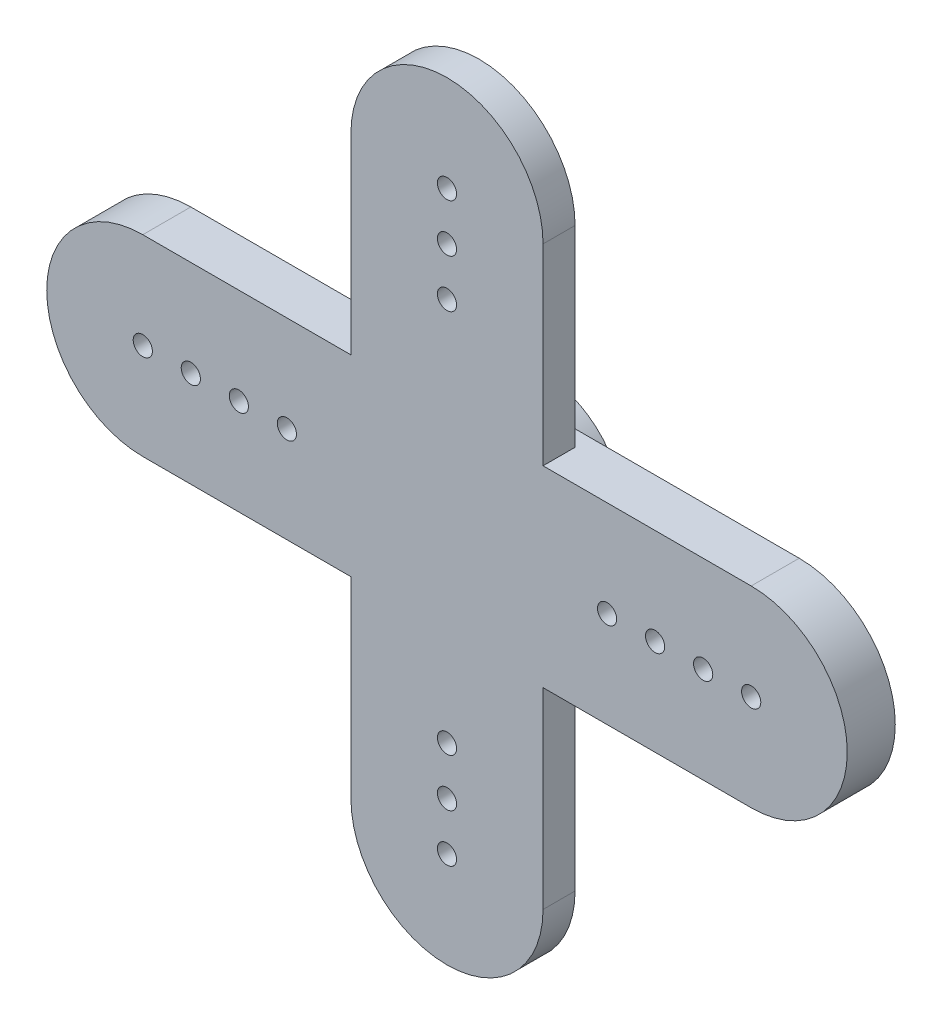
ISO-10303-21;
HEADER;
FILE_DESCRIPTION(('STEP AP214'),'2;1');
FILE_NAME('part.step','',(''),(''),'','','');
FILE_SCHEMA(('AUTOMOTIVE_DESIGN { 1 0 10303 214 1 1 1 1 }'));
ENDSEC;
DATA;
#1=APPLICATION_CONTEXT('core data for automotive mechanical design processes');
#2=APPLICATION_PROTOCOL_DEFINITION('international standard','automotive_design',2000,#1);
#3=PRODUCT_CONTEXT('',#1,'mechanical');
#4=PRODUCT('Part','Part','',(#3));
#5=PRODUCT_RELATED_PRODUCT_CATEGORY('part','',(#4));
#6=PRODUCT_DEFINITION_FORMATION('','',#4);
#7=PRODUCT_DEFINITION_CONTEXT('part definition',#1,'design');
#8=PRODUCT_DEFINITION('design','',#6,#7);
#9=PRODUCT_DEFINITION_SHAPE('','',#8);
#10=(LENGTH_UNIT() NAMED_UNIT(*) SI_UNIT(.MILLI.,.METRE.));
#11=(NAMED_UNIT(*) PLANE_ANGLE_UNIT() SI_UNIT($,.RADIAN.));
#12=(NAMED_UNIT(*) SI_UNIT($,.STERADIAN.) SOLID_ANGLE_UNIT());
#13=UNCERTAINTY_MEASURE_WITH_UNIT(LENGTH_MEASURE(1.E-05),#10,'distance_accuracy_value','');
#14=(GEOMETRIC_REPRESENTATION_CONTEXT(3) GLOBAL_UNCERTAINTY_ASSIGNED_CONTEXT((#13)) GLOBAL_UNIT_ASSIGNED_CONTEXT((#10,
#11,#12)) REPRESENTATION_CONTEXT('',''));
#15=CARTESIAN_POINT('',(0.,0.,0.));
#16=DIRECTION('',(0.,0.,1.));
#17=DIRECTION('',(1.,0.,0.));
#18=AXIS2_PLACEMENT_3D('',#15,#16,#17);
#19=CARTESIAN_POINT('',(-19.,0.,0.));
#20=DIRECTION('',(0.,0.,1.));
#21=DIRECTION('',(1.,0.,0.));
#22=AXIS2_PLACEMENT_3D('',#19,#20,#21);
#23=PLANE('',#22);
#24=CARTESIAN_POINT('',(-10.,0.,0.));
#25=DIRECTION('',(0.,0.,1.));
#26=DIRECTION('',(1.,0.,0.));
#27=AXIS2_PLACEMENT_3D('',#24,#25,#26);
#28=CIRCLE('',#27,0.6);
#29=CARTESIAN_POINT('',(-9.4,0.,0.));
#30=VERTEX_POINT('',#29);
#31=EDGE_CURVE('E180',#30,#30,#28,.T.);
#32=ORIENTED_EDGE('',*,*,#31,.T.);
#33=EDGE_LOOP('',(#32));
#34=FACE_BOUND('',#33,.T.);
#35=CARTESIAN_POINT('',(19.,0.,0.));
#36=DIRECTION('',(0.,0.,1.));
#37=DIRECTION('',(1.,0.,0.));
#38=AXIS2_PLACEMENT_3D('',#35,#36,#37);
#39=CIRCLE('',#38,0.6);
#40=CARTESIAN_POINT('',(19.6,0.,0.));
#41=VERTEX_POINT('',#40);
#42=EDGE_CURVE('E190',#41,#41,#39,.T.);
#43=ORIENTED_EDGE('',*,*,#42,.T.);
#44=EDGE_LOOP('',(#43));
#45=FACE_BOUND('',#44,.T.);
#46=CARTESIAN_POINT('',(13.,0.,0.));
#47=DIRECTION('',(0.,0.,1.));
#48=DIRECTION('',(1.,0.,0.));
#49=AXIS2_PLACEMENT_3D('',#46,#47,#48);
#50=CIRCLE('',#49,0.6);
#51=CARTESIAN_POINT('',(13.6,0.,0.));
#52=VERTEX_POINT('',#51);
#53=EDGE_CURVE('E202',#52,#52,#50,.T.);
#54=ORIENTED_EDGE('',*,*,#53,.T.);
#55=EDGE_LOOP('',(#54));
#56=FACE_BOUND('',#55,.T.);
#57=CARTESIAN_POINT('',(-16.,0.,0.));
#58=DIRECTION('',(0.,0.,1.));
#59=DIRECTION('',(1.,0.,0.));
#60=AXIS2_PLACEMENT_3D('',#57,#58,#59);
#61=CIRCLE('',#60,0.6);
#62=CARTESIAN_POINT('',(-15.4,0.,0.));
#63=VERTEX_POINT('',#62);
#64=EDGE_CURVE('E214',#63,#63,#61,.T.);
#65=ORIENTED_EDGE('',*,*,#64,.T.);
#66=EDGE_LOOP('',(#65));
#67=FACE_BOUND('',#66,.T.);
#68=CARTESIAN_POINT('',(-19.,0.,0.));
#69=DIRECTION('',(0.,0.,1.));
#70=DIRECTION('',(1.,0.,0.));
#71=AXIS2_PLACEMENT_3D('',#68,#69,#70);
#72=CIRCLE('',#71,6.);
#73=CARTESIAN_POINT('',(-19.,6.,0.));
#74=VERTEX_POINT('',#73);
#75=CARTESIAN_POINT('',(-19.,-6.,0.));
#76=VERTEX_POINT('',#75);
#77=EDGE_CURVE('E226',#74,#76,#72,.T.);
#78=ORIENTED_EDGE('',*,*,#77,.F.);
#79=DIRECTION('',(-1.,0.,0.));
#80=VECTOR('',#79,1.);
#81=CARTESIAN_POINT('',(-19.,6.,0.));
#82=LINE('',#81,#80);
#83=CARTESIAN_POINT('',(19.,6.,0.));
#84=VERTEX_POINT('',#83);
#85=EDGE_CURVE('E233',#84,#74,#82,.T.);
#86=ORIENTED_EDGE('',*,*,#85,.F.);
#87=CARTESIAN_POINT('',(19.,0.,0.));
#88=DIRECTION('',(0.,0.,1.));
#89=DIRECTION('',(1.,0.,0.));
#90=AXIS2_PLACEMENT_3D('',#87,#88,#89);
#91=CIRCLE('',#90,6.);
#92=CARTESIAN_POINT('',(19.,-6.,0.));
#93=VERTEX_POINT('',#92);
#94=EDGE_CURVE('E248',#93,#84,#91,.T.);
#95=ORIENTED_EDGE('',*,*,#94,.F.);
#96=DIRECTION('',(1.,0.,0.));
#97=VECTOR('',#96,1.);
#98=CARTESIAN_POINT('',(19.,-6.,0.));
#99=LINE('',#98,#97);
#100=EDGE_CURVE('E246',#76,#93,#99,.T.);
#101=ORIENTED_EDGE('',*,*,#100,.F.);
#102=EDGE_LOOP('',(#78,#86,#95,#101));
#103=FACE_BOUND('',#102,.T.);
#104=CARTESIAN_POINT('',(-19.,0.,0.));
#105=DIRECTION('',(0.,0.,1.));
#106=DIRECTION('',(1.,0.,0.));
#107=AXIS2_PLACEMENT_3D('',#104,#105,#106);
#108=CIRCLE('',#107,0.6);
#109=CARTESIAN_POINT('',(-18.4,0.,0.));
#110=VERTEX_POINT('',#109);
#111=EDGE_CURVE('E220',#110,#110,#108,.T.);
#112=ORIENTED_EDGE('',*,*,#111,.T.);
#113=EDGE_LOOP('',(#112));
#114=FACE_BOUND('',#113,.T.);
#115=CARTESIAN_POINT('',(-13.,0.,0.));
#116=DIRECTION('',(0.,0.,1.));
#117=DIRECTION('',(1.,0.,0.));
#118=AXIS2_PLACEMENT_3D('',#115,#116,#117);
#119=CIRCLE('',#118,0.6);
#120=CARTESIAN_POINT('',(-12.4,0.,0.));
#121=VERTEX_POINT('',#120);
#122=EDGE_CURVE('E208',#121,#121,#119,.T.);
#123=ORIENTED_EDGE('',*,*,#122,.T.);
#124=EDGE_LOOP('',(#123));
#125=FACE_BOUND('',#124,.T.);
#126=CARTESIAN_POINT('',(16.,0.,0.));
#127=DIRECTION('',(0.,0.,1.));
#128=DIRECTION('',(1.,0.,0.));
#129=AXIS2_PLACEMENT_3D('',#126,#127,#128);
#130=CIRCLE('',#129,0.6);
#131=CARTESIAN_POINT('',(16.6,0.,0.));
#132=VERTEX_POINT('',#131);
#133=EDGE_CURVE('E196',#132,#132,#130,.T.);
#134=ORIENTED_EDGE('',*,*,#133,.T.);
#135=EDGE_LOOP('',(#134));
#136=FACE_BOUND('',#135,.T.);
#137=CARTESIAN_POINT('',(10.,0.,0.));
#138=DIRECTION('',(0.,0.,1.));
#139=DIRECTION('',(1.,0.,0.));
#140=AXIS2_PLACEMENT_3D('',#137,#138,#139);
#141=CIRCLE('',#140,0.6);
#142=CARTESIAN_POINT('',(10.6,0.,0.));
#143=VERTEX_POINT('',#142);
#144=EDGE_CURVE('E184',#143,#143,#141,.T.);
#145=ORIENTED_EDGE('',*,*,#144,.T.);
#146=EDGE_LOOP('',(#145));
#147=FACE_BOUND('',#146,.T.);
#148=CARTESIAN_POINT('',(0.,0.,0.));
#149=DIRECTION('',(0.,0.,1.));
#150=DIRECTION('',(1.,0.,0.));
#151=AXIS2_PLACEMENT_3D('',#148,#149,#150);
#152=CIRCLE('',#151,5.);
#153=CARTESIAN_POINT('',(5.,0.,0.));
#154=VERTEX_POINT('',#153);
#155=EDGE_CURVE('E11',#154,#154,#152,.F.);
#156=ORIENTED_EDGE('',*,*,#155,.F.);
#157=EDGE_LOOP('',(#156));
#158=FACE_BOUND('',#157,.T.);
#159=ADVANCED_FACE('F34',(#34,#45,#56,#67,#103,#114,#125,#136,#147,#158),#23,.F.);
#160=CARTESIAN_POINT('',(-19.,0.,3.));
#161=DIRECTION('',(0.,0.,1.));
#162=DIRECTION('',(1.,0.,0.));
#163=AXIS2_PLACEMENT_3D('',#160,#161,#162);
#164=PLANE('',#163);
#165=DIRECTION('',(1.,0.,0.));
#166=VECTOR('',#165,1.);
#167=CARTESIAN_POINT('',(19.,-6.,3.));
#168=LINE('',#167,#166);
#169=CARTESIAN_POINT('',(-19.,-6.,3.));
#170=VERTEX_POINT('',#169);
#171=CARTESIAN_POINT('',(-6.,-6.,3.));
#172=VERTEX_POINT('',#171);
#173=EDGE_CURVE('E234',#170,#172,#168,.T.);
#174=ORIENTED_EDGE('',*,*,#173,.T.);
#175=DIRECTION('',(0.,-1.,0.));
#176=VECTOR('',#175,1.);
#177=CARTESIAN_POINT('',(-6.,18.,3.));
#178=LINE('',#177,#176);
#179=CARTESIAN_POINT('',(-6.,-18.,3.));
#180=VERTEX_POINT('',#179);
#181=EDGE_CURVE('E162',#172,#180,#178,.T.);
#182=ORIENTED_EDGE('',*,*,#181,.T.);
#183=CARTESIAN_POINT('',(0.,-18.,3.));
#184=DIRECTION('',(0.,0.,1.));
#185=DIRECTION('',(1.,0.,0.));
#186=AXIS2_PLACEMENT_3D('',#183,#184,#185);
#187=CIRCLE('',#186,6.);
#188=CARTESIAN_POINT('',(6.,-18.,3.));
#189=VERTEX_POINT('',#188);
#190=EDGE_CURVE('E165',#180,#189,#187,.T.);
#191=ORIENTED_EDGE('',*,*,#190,.T.);
#192=DIRECTION('',(0.,1.,0.));
#193=VECTOR('',#192,1.);
#194=CARTESIAN_POINT('',(6.,18.,3.));
#195=LINE('',#194,#193);
#196=CARTESIAN_POINT('',(6.,-6.,3.));
#197=VERTEX_POINT('',#196);
#198=EDGE_CURVE('E49',#189,#197,#195,.T.);
#199=ORIENTED_EDGE('',*,*,#198,.T.);
#200=CARTESIAN_POINT('',(19.,-6.,3.));
#201=VERTEX_POINT('',#200);
#202=EDGE_CURVE('E232',#197,#201,#168,.T.);
#203=ORIENTED_EDGE('',*,*,#202,.T.);
#204=CARTESIAN_POINT('',(19.,0.,3.));
#205=DIRECTION('',(0.,0.,1.));
#206=DIRECTION('',(1.,0.,0.));
#207=AXIS2_PLACEMENT_3D('',#204,#205,#206);
#208=CIRCLE('',#207,6.);
#209=CARTESIAN_POINT('',(19.,6.,3.));
#210=VERTEX_POINT('',#209);
#211=EDGE_CURVE('E237',#201,#210,#208,.T.);
#212=ORIENTED_EDGE('',*,*,#211,.T.);
#213=DIRECTION('',(-1.,0.,0.));
#214=VECTOR('',#213,1.);
#215=CARTESIAN_POINT('',(-19.,6.,3.));
#216=LINE('',#215,#214);
#217=CARTESIAN_POINT('',(6.,6.,3.));
#218=VERTEX_POINT('',#217);
#219=EDGE_CURVE('E240',#210,#218,#216,.T.);
#220=ORIENTED_EDGE('',*,*,#219,.T.);
#221=CARTESIAN_POINT('',(6.,18.,3.));
#222=VERTEX_POINT('',#221);
#223=EDGE_CURVE('E149',#218,#222,#195,.T.);
#224=ORIENTED_EDGE('',*,*,#223,.T.);
#225=CARTESIAN_POINT('',(0.,18.,3.));
#226=DIRECTION('',(0.,0.,1.));
#227=DIRECTION('',(1.,0.,0.));
#228=AXIS2_PLACEMENT_3D('',#225,#226,#227);
#229=CIRCLE('',#228,6.);
#230=CARTESIAN_POINT('',(-6.,18.,3.));
#231=VERTEX_POINT('',#230);
#232=EDGE_CURVE('E160',#222,#231,#229,.T.);
#233=ORIENTED_EDGE('',*,*,#232,.T.);
#234=CARTESIAN_POINT('',(-6.,6.,3.));
#235=VERTEX_POINT('',#234);
#236=EDGE_CURVE('E56',#231,#235,#178,.T.);
#237=ORIENTED_EDGE('',*,*,#236,.T.);
#238=CARTESIAN_POINT('',(-19.,6.,3.));
#239=VERTEX_POINT('',#238);
#240=EDGE_CURVE('E239',#235,#239,#216,.T.);
#241=ORIENTED_EDGE('',*,*,#240,.T.);
#242=CARTESIAN_POINT('',(-19.,0.,3.));
#243=DIRECTION('',(0.,0.,1.));
#244=DIRECTION('',(1.,0.,0.));
#245=AXIS2_PLACEMENT_3D('',#242,#243,#244);
#246=CIRCLE('',#245,6.);
#247=EDGE_CURVE('E229',#239,#170,#246,.T.);
#248=ORIENTED_EDGE('',*,*,#247,.T.);
#249=EDGE_LOOP('',(#174,#182,#191,#199,#203,#212,#220,#224,#233,#237,#241,#248));
#250=FACE_BOUND('',#249,.T.);
#251=CARTESIAN_POINT('',(-13.,0.,3.));
#252=DIRECTION('',(0.,0.,1.));
#253=DIRECTION('',(1.,0.,0.));
#254=AXIS2_PLACEMENT_3D('',#251,#252,#253);
#255=CIRCLE('',#254,0.6);
#256=CARTESIAN_POINT('',(-12.4,0.,3.));
#257=VERTEX_POINT('',#256);
#258=EDGE_CURVE('E211',#257,#257,#255,.T.);
#259=ORIENTED_EDGE('',*,*,#258,.F.);
#260=EDGE_LOOP('',(#259));
#261=FACE_BOUND('',#260,.T.);
#262=CARTESIAN_POINT('',(-19.,0.,3.));
#263=DIRECTION('',(0.,0.,1.));
#264=DIRECTION('',(1.,0.,0.));
#265=AXIS2_PLACEMENT_3D('',#262,#263,#264);
#266=CIRCLE('',#265,0.6);
#267=CARTESIAN_POINT('',(-18.4,0.,3.));
#268=VERTEX_POINT('',#267);
#269=EDGE_CURVE('E223',#268,#268,#266,.T.);
#270=ORIENTED_EDGE('',*,*,#269,.F.);
#271=EDGE_LOOP('',(#270));
#272=FACE_BOUND('',#271,.T.);
#273=CARTESIAN_POINT('',(-16.,0.,3.));
#274=DIRECTION('',(0.,0.,1.));
#275=DIRECTION('',(1.,0.,0.));
#276=AXIS2_PLACEMENT_3D('',#273,#274,#275);
#277=CIRCLE('',#276,0.6);
#278=CARTESIAN_POINT('',(-15.4,0.,3.));
#279=VERTEX_POINT('',#278);
#280=EDGE_CURVE('E217',#279,#279,#277,.T.);
#281=ORIENTED_EDGE('',*,*,#280,.F.);
#282=EDGE_LOOP('',(#281));
#283=FACE_BOUND('',#282,.T.);
#284=CARTESIAN_POINT('',(-10.,0.,3.));
#285=DIRECTION('',(0.,0.,1.));
#286=DIRECTION('',(1.,0.,0.));
#287=AXIS2_PLACEMENT_3D('',#284,#285,#286);
#288=CIRCLE('',#287,0.6);
#289=CARTESIAN_POINT('',(-9.4,0.,3.));
#290=VERTEX_POINT('',#289);
#291=EDGE_CURVE('E181',#290,#290,#288,.T.);
#292=ORIENTED_EDGE('',*,*,#291,.F.);
#293=EDGE_LOOP('',(#292));
#294=FACE_BOUND('',#293,.T.);
#295=CARTESIAN_POINT('',(0.,18.,3.));
#296=DIRECTION('',(0.,0.,1.));
#297=DIRECTION('',(1.,0.,0.));
#298=AXIS2_PLACEMENT_3D('',#295,#296,#297);
#299=CIRCLE('',#298,0.6);
#300=CARTESIAN_POINT('',(0.6,18.,3.));
#301=VERTEX_POINT('',#300);
#302=EDGE_CURVE('E152',#301,#301,#299,.T.);
#303=ORIENTED_EDGE('',*,*,#302,.F.);
#304=EDGE_LOOP('',(#303));
#305=FACE_BOUND('',#304,.T.);
#306=CARTESIAN_POINT('',(0.,15.,3.));
#307=DIRECTION('',(0.,0.,1.));
#308=DIRECTION('',(1.,0.,0.));
#309=AXIS2_PLACEMENT_3D('',#306,#307,#308);
#310=CIRCLE('',#309,0.6);
#311=CARTESIAN_POINT('',(0.6,15.,3.));
#312=VERTEX_POINT('',#311);
#313=EDGE_CURVE('E553',#312,#312,#310,.T.);
#314=ORIENTED_EDGE('',*,*,#313,.F.);
#315=EDGE_LOOP('',(#314));
#316=FACE_BOUND('',#315,.T.);
#317=CARTESIAN_POINT('',(0.,12.,3.));
#318=DIRECTION('',(0.,0.,1.));
#319=DIRECTION('',(1.,0.,0.));
#320=AXIS2_PLACEMENT_3D('',#317,#318,#319);
#321=CIRCLE('',#320,0.6);
#322=CARTESIAN_POINT('',(0.6,12.,3.));
#323=VERTEX_POINT('',#322);
#324=EDGE_CURVE('E547',#323,#323,#321,.T.);
#325=ORIENTED_EDGE('',*,*,#324,.F.);
#326=EDGE_LOOP('',(#325));
#327=FACE_BOUND('',#326,.T.);
#328=CARTESIAN_POINT('',(0.,-12.,3.));
#329=DIRECTION('',(0.,0.,1.));
#330=DIRECTION('',(1.,0.,0.));
#331=AXIS2_PLACEMENT_3D('',#328,#329,#330);
#332=CIRCLE('',#331,0.6);
#333=CARTESIAN_POINT('',(0.6,-12.,3.));
#334=VERTEX_POINT('',#333);
#335=EDGE_CURVE('E541',#334,#334,#332,.T.);
#336=ORIENTED_EDGE('',*,*,#335,.F.);
#337=EDGE_LOOP('',(#336));
#338=FACE_BOUND('',#337,.T.);
#339=CARTESIAN_POINT('',(0.,-15.,3.));
#340=DIRECTION('',(0.,0.,1.));
#341=DIRECTION('',(1.,0.,0.));
#342=AXIS2_PLACEMENT_3D('',#339,#340,#341);
#343=CIRCLE('',#342,0.6);
#344=CARTESIAN_POINT('',(0.6,-15.,3.));
#345=VERTEX_POINT('',#344);
#346=EDGE_CURVE('E535',#345,#345,#343,.T.);
#347=ORIENTED_EDGE('',*,*,#346,.F.);
#348=EDGE_LOOP('',(#347));
#349=FACE_BOUND('',#348,.T.);
#350=CARTESIAN_POINT('',(0.,-18.,3.));
#351=DIRECTION('',(0.,0.,1.));
#352=DIRECTION('',(1.,0.,0.));
#353=AXIS2_PLACEMENT_3D('',#350,#351,#352);
#354=CIRCLE('',#353,0.6);
#355=CARTESIAN_POINT('',(0.6,-18.,3.));
#356=VERTEX_POINT('',#355);
#357=EDGE_CURVE('E527',#356,#356,#354,.T.);
#358=ORIENTED_EDGE('',*,*,#357,.F.);
#359=EDGE_LOOP('',(#358));
#360=FACE_BOUND('',#359,.T.);
#361=CARTESIAN_POINT('',(19.,0.,3.));
#362=DIRECTION('',(0.,0.,1.));
#363=DIRECTION('',(1.,0.,0.));
#364=AXIS2_PLACEMENT_3D('',#361,#362,#363);
#365=CIRCLE('',#364,0.6);
#366=CARTESIAN_POINT('',(19.6,0.,3.));
#367=VERTEX_POINT('',#366);
#368=EDGE_CURVE('E193',#367,#367,#365,.T.);
#369=ORIENTED_EDGE('',*,*,#368,.F.);
#370=EDGE_LOOP('',(#369));
#371=FACE_BOUND('',#370,.T.);
#372=CARTESIAN_POINT('',(13.,0.,3.));
#373=DIRECTION('',(0.,0.,1.));
#374=DIRECTION('',(1.,0.,0.));
#375=AXIS2_PLACEMENT_3D('',#372,#373,#374);
#376=CIRCLE('',#375,0.6);
#377=CARTESIAN_POINT('',(13.6,0.,3.));
#378=VERTEX_POINT('',#377);
#379=EDGE_CURVE('E205',#378,#378,#376,.T.);
#380=ORIENTED_EDGE('',*,*,#379,.F.);
#381=EDGE_LOOP('',(#380));
#382=FACE_BOUND('',#381,.T.);
#383=CARTESIAN_POINT('',(16.,0.,3.));
#384=DIRECTION('',(0.,0.,1.));
#385=DIRECTION('',(1.,0.,0.));
#386=AXIS2_PLACEMENT_3D('',#383,#384,#385);
#387=CIRCLE('',#386,0.6);
#388=CARTESIAN_POINT('',(16.6,0.,3.));
#389=VERTEX_POINT('',#388);
#390=EDGE_CURVE('E199',#389,#389,#387,.T.);
#391=ORIENTED_EDGE('',*,*,#390,.F.);
#392=EDGE_LOOP('',(#391));
#393=FACE_BOUND('',#392,.T.);
#394=CARTESIAN_POINT('',(10.,0.,3.));
#395=DIRECTION('',(0.,0.,1.));
#396=DIRECTION('',(1.,0.,0.));
#397=AXIS2_PLACEMENT_3D('',#394,#395,#396);
#398=CIRCLE('',#397,0.6);
#399=CARTESIAN_POINT('',(10.6,0.,3.));
#400=VERTEX_POINT('',#399);
#401=EDGE_CURVE('E187',#400,#400,#398,.T.);
#402=ORIENTED_EDGE('',*,*,#401,.F.);
#403=EDGE_LOOP('',(#402));
#404=FACE_BOUND('',#403,.T.);
#405=ADVANCED_FACE('F269',(#250,#261,#272,#283,#294,#305,#316,#327,#338,#349,#360,#371,#382,
#393,#404),#164,.T.);
#406=CARTESIAN_POINT('',(-19.,0.,3.));
#407=DIRECTION('',(0.,0.,-1.));
#408=DIRECTION('',(-1.,0.,0.));
#409=AXIS2_PLACEMENT_3D('',#406,#407,#408);
#410=CYLINDRICAL_SURFACE('',#409,6.);
#411=ORIENTED_EDGE('',*,*,#77,.T.);
#412=DIRECTION('',(0.,0.,-1.));
#413=VECTOR('',#412,1.);
#414=CARTESIAN_POINT('',(-19.,-6.,3.));
#415=LINE('',#414,#413);
#416=EDGE_CURVE('E259',#170,#76,#415,.T.);
#417=ORIENTED_EDGE('',*,*,#416,.F.);
#418=ORIENTED_EDGE('',*,*,#247,.F.);
#419=DIRECTION('',(0.,0.,-1.));
#420=VECTOR('',#419,1.);
#421=CARTESIAN_POINT('',(-19.,6.,3.));
#422=LINE('',#421,#420);
#423=EDGE_CURVE('E243',#239,#74,#422,.T.);
#424=ORIENTED_EDGE('',*,*,#423,.T.);
#425=EDGE_LOOP('',(#411,#417,#418,#424));
#426=FACE_BOUND('',#425,.T.);
#427=ADVANCED_FACE('F36',(#426),#410,.T.);
#428=CARTESIAN_POINT('',(19.,-6.,3.));
#429=DIRECTION('',(0.,1.,0.));
#430=DIRECTION('',(-1.,0.,0.));
#431=AXIS2_PLACEMENT_3D('',#428,#429,#430);
#432=PLANE('',#431);
#433=ORIENTED_EDGE('',*,*,#202,.F.);
#434=DIRECTION('',(0.,0.,-1.));
#435=VECTOR('',#434,1.);
#436=CARTESIAN_POINT('',(6.,-6.,3.));
#437=LINE('',#436,#435);
#438=CARTESIAN_POINT('',(6.,-6.,1.));
#439=VERTEX_POINT('',#438);
#440=EDGE_CURVE('E177',#197,#439,#437,.T.);
#441=ORIENTED_EDGE('',*,*,#440,.T.);
#442=DIRECTION('',(1.,0.,0.));
#443=VECTOR('',#442,1.);
#444=CARTESIAN_POINT('',(19.,-6.,1.));
#445=LINE('',#444,#443);
#446=CARTESIAN_POINT('',(-6.,-6.,1.));
#447=VERTEX_POINT('',#446);
#448=EDGE_CURVE('E168',#447,#439,#445,.T.);
#449=ORIENTED_EDGE('',*,*,#448,.F.);
#450=DIRECTION('',(0.,0.,1.));
#451=VECTOR('',#450,1.);
#452=CARTESIAN_POINT('',(-6.,-6.,3.));
#453=LINE('',#452,#451);
#454=EDGE_CURVE('E174',#447,#172,#453,.T.);
#455=ORIENTED_EDGE('',*,*,#454,.T.);
#456=ORIENTED_EDGE('',*,*,#173,.F.);
#457=ORIENTED_EDGE('',*,*,#416,.T.);
#458=ORIENTED_EDGE('',*,*,#100,.T.);
#459=DIRECTION('',(0.,0.,-1.));
#460=VECTOR('',#459,1.);
#461=CARTESIAN_POINT('',(19.,-6.,3.));
#462=LINE('',#461,#460);
#463=EDGE_CURVE('E256',#201,#93,#462,.T.);
#464=ORIENTED_EDGE('',*,*,#463,.F.);
#465=EDGE_LOOP('',(#433,#441,#449,#455,#456,#457,#458,#464));
#466=FACE_BOUND('',#465,.T.);
#467=ADVANCED_FACE('F288',(#466),#432,.F.);
#468=CARTESIAN_POINT('',(19.,0.,3.));
#469=DIRECTION('',(0.,0.,-1.));
#470=DIRECTION('',(-1.,0.,0.));
#471=AXIS2_PLACEMENT_3D('',#468,#469,#470);
#472=CYLINDRICAL_SURFACE('',#471,6.);
#473=ORIENTED_EDGE('',*,*,#94,.T.);
#474=DIRECTION('',(0.,0.,-1.));
#475=VECTOR('',#474,1.);
#476=CARTESIAN_POINT('',(19.,6.,3.));
#477=LINE('',#476,#475);
#478=EDGE_CURVE('E253',#210,#84,#477,.T.);
#479=ORIENTED_EDGE('',*,*,#478,.F.);
#480=ORIENTED_EDGE('',*,*,#211,.F.);
#481=ORIENTED_EDGE('',*,*,#463,.T.);
#482=EDGE_LOOP('',(#473,#479,#480,#481));
#483=FACE_BOUND('',#482,.T.);
#484=ADVANCED_FACE('F276',(#483),#472,.T.);
#485=CARTESIAN_POINT('',(-19.,6.,3.));
#486=DIRECTION('',(0.,-1.,0.));
#487=DIRECTION('',(1.,0.,0.));
#488=AXIS2_PLACEMENT_3D('',#485,#486,#487);
#489=PLANE('',#488);
#490=DIRECTION('',(-1.,0.,0.));
#491=VECTOR('',#490,1.);
#492=CARTESIAN_POINT('',(-19.,6.,1.));
#493=LINE('',#492,#491);
#494=CARTESIAN_POINT('',(6.,6.,1.));
#495=VERTEX_POINT('',#494);
#496=CARTESIAN_POINT('',(-6.,6.,1.));
#497=VERTEX_POINT('',#496);
#498=EDGE_CURVE('E140',#495,#497,#493,.T.);
#499=ORIENTED_EDGE('',*,*,#498,.F.);
#500=DIRECTION('',(0.,0.,1.));
#501=VECTOR('',#500,1.);
#502=CARTESIAN_POINT('',(6.,6.,3.));
#503=LINE('',#502,#501);
#504=EDGE_CURVE('E42',#495,#218,#503,.T.);
#505=ORIENTED_EDGE('',*,*,#504,.T.);
#506=ORIENTED_EDGE('',*,*,#219,.F.);
#507=ORIENTED_EDGE('',*,*,#478,.T.);
#508=ORIENTED_EDGE('',*,*,#85,.T.);
#509=ORIENTED_EDGE('',*,*,#423,.F.);
#510=ORIENTED_EDGE('',*,*,#240,.F.);
#511=DIRECTION('',(0.,0.,-1.));
#512=VECTOR('',#511,1.);
#513=CARTESIAN_POINT('',(-6.,6.,3.));
#514=LINE('',#513,#512);
#515=EDGE_CURVE('E263',#235,#497,#514,.T.);
#516=ORIENTED_EDGE('',*,*,#515,.T.);
#517=EDGE_LOOP('',(#499,#505,#506,#507,#508,#509,#510,#516));
#518=FACE_BOUND('',#517,.T.);
#519=ADVANCED_FACE('F267',(#518),#489,.F.);
#520=CARTESIAN_POINT('',(-19.,0.,3.));
#521=DIRECTION('',(0.,0.,-1.));
#522=DIRECTION('',(-1.,0.,0.));
#523=AXIS2_PLACEMENT_3D('',#520,#521,#522);
#524=CYLINDRICAL_SURFACE('',#523,0.6);
#525=ORIENTED_EDGE('',*,*,#269,.T.);
#526=EDGE_LOOP('',(#525));
#527=FACE_BOUND('',#526,.T.);
#528=ORIENTED_EDGE('',*,*,#111,.F.);
#529=EDGE_LOOP('',(#528));
#530=FACE_BOUND('',#529,.T.);
#531=ADVANCED_FACE('F325',(#527,#530),#524,.F.);
#532=CARTESIAN_POINT('',(-16.,0.,3.));
#533=DIRECTION('',(0.,0.,-1.));
#534=DIRECTION('',(-1.,0.,0.));
#535=AXIS2_PLACEMENT_3D('',#532,#533,#534);
#536=CYLINDRICAL_SURFACE('',#535,0.6);
#537=ORIENTED_EDGE('',*,*,#280,.T.);
#538=EDGE_LOOP('',(#537));
#539=FACE_BOUND('',#538,.T.);
#540=ORIENTED_EDGE('',*,*,#64,.F.);
#541=EDGE_LOOP('',(#540));
#542=FACE_BOUND('',#541,.T.);
#543=ADVANCED_FACE('F613',(#539,#542),#536,.F.);
#544=CARTESIAN_POINT('',(-13.,0.,3.));
#545=DIRECTION('',(0.,0.,-1.));
#546=DIRECTION('',(-1.,0.,0.));
#547=AXIS2_PLACEMENT_3D('',#544,#545,#546);
#548=CYLINDRICAL_SURFACE('',#547,0.6);
#549=ORIENTED_EDGE('',*,*,#258,.T.);
#550=EDGE_LOOP('',(#549));
#551=FACE_BOUND('',#550,.T.);
#552=ORIENTED_EDGE('',*,*,#122,.F.);
#553=EDGE_LOOP('',(#552));
#554=FACE_BOUND('',#553,.T.);
#555=ADVANCED_FACE('F609',(#551,#554),#548,.F.);
#556=CARTESIAN_POINT('',(13.,0.,3.));
#557=DIRECTION('',(0.,0.,-1.));
#558=DIRECTION('',(-1.,0.,0.));
#559=AXIS2_PLACEMENT_3D('',#556,#557,#558);
#560=CYLINDRICAL_SURFACE('',#559,0.6);
#561=ORIENTED_EDGE('',*,*,#379,.T.);
#562=EDGE_LOOP('',(#561));
#563=FACE_BOUND('',#562,.T.);
#564=ORIENTED_EDGE('',*,*,#53,.F.);
#565=EDGE_LOOP('',(#564));
#566=FACE_BOUND('',#565,.T.);
#567=ADVANCED_FACE('F605',(#563,#566),#560,.F.);
#568=CARTESIAN_POINT('',(16.,0.,3.));
#569=DIRECTION('',(0.,0.,-1.));
#570=DIRECTION('',(-1.,0.,0.));
#571=AXIS2_PLACEMENT_3D('',#568,#569,#570);
#572=CYLINDRICAL_SURFACE('',#571,0.6);
#573=ORIENTED_EDGE('',*,*,#390,.T.);
#574=EDGE_LOOP('',(#573));
#575=FACE_BOUND('',#574,.T.);
#576=ORIENTED_EDGE('',*,*,#133,.F.);
#577=EDGE_LOOP('',(#576));
#578=FACE_BOUND('',#577,.T.);
#579=ADVANCED_FACE('F599',(#575,#578),#572,.F.);
#580=CARTESIAN_POINT('',(19.,0.,3.));
#581=DIRECTION('',(0.,0.,-1.));
#582=DIRECTION('',(-1.,0.,0.));
#583=AXIS2_PLACEMENT_3D('',#580,#581,#582);
#584=CYLINDRICAL_SURFACE('',#583,0.6);
#585=ORIENTED_EDGE('',*,*,#368,.T.);
#586=EDGE_LOOP('',(#585));
#587=FACE_BOUND('',#586,.T.);
#588=ORIENTED_EDGE('',*,*,#42,.F.);
#589=EDGE_LOOP('',(#588));
#590=FACE_BOUND('',#589,.T.);
#591=ADVANCED_FACE('F588',(#587,#590),#584,.F.);
#592=CARTESIAN_POINT('',(10.,0.,3.));
#593=DIRECTION('',(0.,0.,-1.));
#594=DIRECTION('',(-1.,0.,0.));
#595=AXIS2_PLACEMENT_3D('',#592,#593,#594);
#596=CYLINDRICAL_SURFACE('',#595,0.6);
#597=ORIENTED_EDGE('',*,*,#401,.T.);
#598=EDGE_LOOP('',(#597));
#599=FACE_BOUND('',#598,.T.);
#600=ORIENTED_EDGE('',*,*,#144,.F.);
#601=EDGE_LOOP('',(#600));
#602=FACE_BOUND('',#601,.T.);
#603=ADVANCED_FACE('F585',(#599,#602),#596,.F.);
#604=CARTESIAN_POINT('',(-10.,0.,3.));
#605=DIRECTION('',(0.,0.,-1.));
#606=DIRECTION('',(-1.,0.,0.));
#607=AXIS2_PLACEMENT_3D('',#604,#605,#606);
#608=CYLINDRICAL_SURFACE('',#607,0.6);
#609=ORIENTED_EDGE('',*,*,#291,.T.);
#610=EDGE_LOOP('',(#609));
#611=FACE_BOUND('',#610,.T.);
#612=ORIENTED_EDGE('',*,*,#31,.F.);
#613=EDGE_LOOP('',(#612));
#614=FACE_BOUND('',#613,.T.);
#615=ADVANCED_FACE('F346',(#611,#614),#608,.F.);
#616=CARTESIAN_POINT('',(0.,18.,1.));
#617=DIRECTION('',(0.,0.,1.));
#618=DIRECTION('',(1.,0.,0.));
#619=AXIS2_PLACEMENT_3D('',#616,#617,#618);
#620=CYLINDRICAL_SURFACE('',#619,6.);
#621=ORIENTED_EDGE('',*,*,#232,.F.);
#622=DIRECTION('',(0.,0.,1.));
#623=VECTOR('',#622,1.);
#624=CARTESIAN_POINT('',(6.,18.,1.));
#625=LINE('',#624,#623);
#626=CARTESIAN_POINT('',(6.,18.,1.));
#627=VERTEX_POINT('',#626);
#628=EDGE_CURVE('E147',#627,#222,#625,.T.);
#629=ORIENTED_EDGE('',*,*,#628,.F.);
#630=CARTESIAN_POINT('',(0.,18.,1.));
#631=DIRECTION('',(0.,0.,1.));
#632=DIRECTION('',(1.,0.,0.));
#633=AXIS2_PLACEMENT_3D('',#630,#631,#632);
#634=CIRCLE('',#633,6.);
#635=CARTESIAN_POINT('',(-6.,18.,1.));
#636=VERTEX_POINT('',#635);
#637=EDGE_CURVE('E138',#627,#636,#634,.T.);
#638=ORIENTED_EDGE('',*,*,#637,.T.);
#639=DIRECTION('',(0.,0.,1.));
#640=VECTOR('',#639,1.);
#641=CARTESIAN_POINT('',(-6.,18.,1.));
#642=LINE('',#641,#640);
#643=EDGE_CURVE('E123',#636,#231,#642,.T.);
#644=ORIENTED_EDGE('',*,*,#643,.T.);
#645=EDGE_LOOP('',(#621,#629,#638,#644));
#646=FACE_BOUND('',#645,.T.);
#647=ADVANCED_FACE('F145',(#646),#620,.T.);
#648=CARTESIAN_POINT('',(0.,12.,1.));
#649=DIRECTION('',(0.,0.,1.));
#650=DIRECTION('',(1.,0.,0.));
#651=AXIS2_PLACEMENT_3D('',#648,#649,#650);
#652=CYLINDRICAL_SURFACE('',#651,0.6);
#653=CARTESIAN_POINT('',(0.,12.,1.));
#654=DIRECTION('',(0.,0.,1.));
#655=DIRECTION('',(1.,0.,0.));
#656=AXIS2_PLACEMENT_3D('',#653,#654,#655);
#657=CIRCLE('',#656,0.6);
#658=CARTESIAN_POINT('',(0.6,12.,1.));
#659=VERTEX_POINT('',#658);
#660=EDGE_CURVE('E550',#659,#659,#657,.T.);
#661=ORIENTED_EDGE('',*,*,#660,.F.);
#662=EDGE_LOOP('',(#661));
#663=FACE_BOUND('',#662,.T.);
#664=ORIENTED_EDGE('',*,*,#324,.T.);
#665=EDGE_LOOP('',(#664));
#666=FACE_BOUND('',#665,.T.);
#667=ADVANCED_FACE('F367',(#663,#666),#652,.F.);
#668=CARTESIAN_POINT('',(0.,15.,1.));
#669=DIRECTION('',(0.,0.,1.));
#670=DIRECTION('',(1.,0.,0.));
#671=AXIS2_PLACEMENT_3D('',#668,#669,#670);
#672=CYLINDRICAL_SURFACE('',#671,0.6);
#673=CARTESIAN_POINT('',(0.,15.,1.));
#674=DIRECTION('',(0.,0.,1.));
#675=DIRECTION('',(1.,0.,0.));
#676=AXIS2_PLACEMENT_3D('',#673,#674,#675);
#677=CIRCLE('',#676,0.6);
#678=CARTESIAN_POINT('',(0.6,15.,1.));
#679=VERTEX_POINT('',#678);
#680=EDGE_CURVE('E556',#679,#679,#677,.T.);
#681=ORIENTED_EDGE('',*,*,#680,.F.);
#682=EDGE_LOOP('',(#681));
#683=FACE_BOUND('',#682,.T.);
#684=ORIENTED_EDGE('',*,*,#313,.T.);
#685=EDGE_LOOP('',(#684));
#686=FACE_BOUND('',#685,.T.);
#687=ADVANCED_FACE('F376',(#683,#686),#672,.F.);
#688=CARTESIAN_POINT('',(0.,18.,1.));
#689=DIRECTION('',(0.,0.,1.));
#690=DIRECTION('',(1.,0.,0.));
#691=AXIS2_PLACEMENT_3D('',#688,#689,#690);
#692=CYLINDRICAL_SURFACE('',#691,0.6);
#693=CARTESIAN_POINT('',(0.,18.,1.));
#694=DIRECTION('',(0.,0.,1.));
#695=DIRECTION('',(1.,0.,0.));
#696=AXIS2_PLACEMENT_3D('',#693,#694,#695);
#697=CIRCLE('',#696,0.6);
#698=CARTESIAN_POINT('',(0.6,18.,1.));
#699=VERTEX_POINT('',#698);
#700=EDGE_CURVE('E163',#699,#699,#697,.T.);
#701=ORIENTED_EDGE('',*,*,#700,.F.);
#702=EDGE_LOOP('',(#701));
#703=FACE_BOUND('',#702,.T.);
#704=ORIENTED_EDGE('',*,*,#302,.T.);
#705=EDGE_LOOP('',(#704));
#706=FACE_BOUND('',#705,.T.);
#707=ADVANCED_FACE('F386',(#703,#706),#692,.F.);
#708=CARTESIAN_POINT('',(0.,18.,1.));
#709=DIRECTION('',(0.,0.,1.));
#710=DIRECTION('',(1.,0.,0.));
#711=AXIS2_PLACEMENT_3D('',#708,#709,#710);
#712=PLANE('',#711);
#713=ORIENTED_EDGE('',*,*,#700,.T.);
#714=EDGE_LOOP('',(#713));
#715=FACE_BOUND('',#714,.T.);
#716=ORIENTED_EDGE('',*,*,#680,.T.);
#717=EDGE_LOOP('',(#716));
#718=FACE_BOUND('',#717,.T.);
#719=ORIENTED_EDGE('',*,*,#660,.T.);
#720=EDGE_LOOP('',(#719));
#721=FACE_BOUND('',#720,.T.);
#722=DIRECTION('',(0.,1.,0.));
#723=VECTOR('',#722,1.);
#724=CARTESIAN_POINT('',(6.,18.,1.));
#725=LINE('',#724,#723);
#726=EDGE_CURVE('E157',#495,#627,#725,.T.);
#727=ORIENTED_EDGE('',*,*,#726,.F.);
#728=ORIENTED_EDGE('',*,*,#498,.T.);
#729=DIRECTION('',(0.,-1.,0.));
#730=VECTOR('',#729,1.);
#731=CARTESIAN_POINT('',(-6.,18.,1.));
#732=LINE('',#731,#730);
#733=EDGE_CURVE('E126',#636,#497,#732,.T.);
#734=ORIENTED_EDGE('',*,*,#733,.F.);
#735=ORIENTED_EDGE('',*,*,#637,.F.);
#736=EDGE_LOOP('',(#727,#728,#734,#735));
#737=FACE_BOUND('',#736,.T.);
#738=ADVANCED_FACE('F137',(#715,#718,#721,#737),#712,.F.);
#739=CARTESIAN_POINT('',(-6.,18.,1.));
#740=DIRECTION('',(-1.,0.,0.));
#741=DIRECTION('',(0.,0.,1.));
#742=AXIS2_PLACEMENT_3D('',#739,#740,#741);
#743=PLANE('',#742);
#744=ORIENTED_EDGE('',*,*,#515,.F.);
#745=ORIENTED_EDGE('',*,*,#236,.F.);
#746=ORIENTED_EDGE('',*,*,#643,.F.);
#747=ORIENTED_EDGE('',*,*,#733,.T.);
#748=EDGE_LOOP('',(#744,#745,#746,#747));
#749=FACE_BOUND('',#748,.T.);
#750=ADVANCED_FACE('F125',(#749),#743,.T.);
#751=CARTESIAN_POINT('',(6.,18.,1.));
#752=DIRECTION('',(1.,0.,0.));
#753=DIRECTION('',(0.,0.,-1.));
#754=AXIS2_PLACEMENT_3D('',#751,#752,#753);
#755=PLANE('',#754);
#756=ORIENTED_EDGE('',*,*,#504,.F.);
#757=ORIENTED_EDGE('',*,*,#726,.T.);
#758=ORIENTED_EDGE('',*,*,#628,.T.);
#759=ORIENTED_EDGE('',*,*,#223,.F.);
#760=EDGE_LOOP('',(#756,#757,#758,#759));
#761=FACE_BOUND('',#760,.T.);
#762=ADVANCED_FACE('F304',(#761),#755,.T.);
#763=ORIENTED_EDGE('',*,*,#440,.F.);
#764=ORIENTED_EDGE('',*,*,#198,.F.);
#765=DIRECTION('',(0.,0.,1.));
#766=VECTOR('',#765,1.);
#767=CARTESIAN_POINT('',(6.,-18.,1.));
#768=LINE('',#767,#766);
#769=CARTESIAN_POINT('',(6.,-18.,1.));
#770=VERTEX_POINT('',#769);
#771=EDGE_CURVE('E169',#770,#189,#768,.T.);
#772=ORIENTED_EDGE('',*,*,#771,.F.);
#773=EDGE_CURVE('E132',#770,#439,#725,.T.);
#774=ORIENTED_EDGE('',*,*,#773,.T.);
#775=EDGE_LOOP('',(#763,#764,#772,#774));
#776=FACE_BOUND('',#775,.T.);
#777=ADVANCED_FACE('F302',(#776),#755,.T.);
#778=ORIENTED_EDGE('',*,*,#454,.F.);
#779=CARTESIAN_POINT('',(-6.,-18.,1.));
#780=VERTEX_POINT('',#779);
#781=EDGE_CURVE('E142',#447,#780,#732,.T.);
#782=ORIENTED_EDGE('',*,*,#781,.T.);
#783=DIRECTION('',(0.,0.,1.));
#784=VECTOR('',#783,1.);
#785=CARTESIAN_POINT('',(-6.,-18.,1.));
#786=LINE('',#785,#784);
#787=EDGE_CURVE('E131',#780,#180,#786,.T.);
#788=ORIENTED_EDGE('',*,*,#787,.T.);
#789=ORIENTED_EDGE('',*,*,#181,.F.);
#790=EDGE_LOOP('',(#778,#782,#788,#789));
#791=FACE_BOUND('',#790,.T.);
#792=ADVANCED_FACE('F292',(#791),#743,.T.);
#793=CARTESIAN_POINT('',(0.,-12.,1.));
#794=DIRECTION('',(0.,0.,1.));
#795=DIRECTION('',(1.,0.,0.));
#796=AXIS2_PLACEMENT_3D('',#793,#794,#795);
#797=CIRCLE('',#796,0.6);
#798=CARTESIAN_POINT('',(0.6,-12.,1.));
#799=VERTEX_POINT('',#798);
#800=EDGE_CURVE('E544',#799,#799,#797,.T.);
#801=ORIENTED_EDGE('',*,*,#800,.T.);
#802=EDGE_LOOP('',(#801));
#803=FACE_BOUND('',#802,.T.);
#804=CARTESIAN_POINT('',(0.,-15.,1.));
#805=DIRECTION('',(0.,0.,1.));
#806=DIRECTION('',(1.,0.,0.));
#807=AXIS2_PLACEMENT_3D('',#804,#805,#806);
#808=CIRCLE('',#807,0.6);
#809=CARTESIAN_POINT('',(0.6,-15.,1.));
#810=VERTEX_POINT('',#809);
#811=EDGE_CURVE('E538',#810,#810,#808,.T.);
#812=ORIENTED_EDGE('',*,*,#811,.T.);
#813=EDGE_LOOP('',(#812));
#814=FACE_BOUND('',#813,.T.);
#815=CARTESIAN_POINT('',(0.,-18.,1.));
#816=DIRECTION('',(0.,0.,1.));
#817=DIRECTION('',(1.,0.,0.));
#818=AXIS2_PLACEMENT_3D('',#815,#816,#817);
#819=CIRCLE('',#818,0.6);
#820=CARTESIAN_POINT('',(0.6,-18.,1.));
#821=VERTEX_POINT('',#820);
#822=EDGE_CURVE('E532',#821,#821,#819,.T.);
#823=ORIENTED_EDGE('',*,*,#822,.T.);
#824=EDGE_LOOP('',(#823));
#825=FACE_BOUND('',#824,.T.);
#826=ORIENTED_EDGE('',*,*,#781,.F.);
#827=ORIENTED_EDGE('',*,*,#448,.T.);
#828=ORIENTED_EDGE('',*,*,#773,.F.);
#829=CARTESIAN_POINT('',(0.,-18.,1.));
#830=DIRECTION('',(0.,0.,1.));
#831=DIRECTION('',(1.,0.,0.));
#832=AXIS2_PLACEMENT_3D('',#829,#830,#831);
#833=CIRCLE('',#832,6.);
#834=EDGE_CURVE('E141',#780,#770,#833,.T.);
#835=ORIENTED_EDGE('',*,*,#834,.F.);
#836=EDGE_LOOP('',(#826,#827,#828,#835));
#837=FACE_BOUND('',#836,.T.);
#838=ADVANCED_FACE('F296',(#803,#814,#825,#837),#712,.F.);
#839=CARTESIAN_POINT('',(0.,-18.,1.));
#840=DIRECTION('',(0.,0.,1.));
#841=DIRECTION('',(1.,0.,0.));
#842=AXIS2_PLACEMENT_3D('',#839,#840,#841);
#843=CYLINDRICAL_SURFACE('',#842,6.);
#844=ORIENTED_EDGE('',*,*,#190,.F.);
#845=ORIENTED_EDGE('',*,*,#787,.F.);
#846=ORIENTED_EDGE('',*,*,#834,.T.);
#847=ORIENTED_EDGE('',*,*,#771,.T.);
#848=EDGE_LOOP('',(#844,#845,#846,#847));
#849=FACE_BOUND('',#848,.T.);
#850=ADVANCED_FACE('F300',(#849),#843,.T.);
#851=CARTESIAN_POINT('',(0.,-12.,1.));
#852=DIRECTION('',(0.,0.,1.));
#853=DIRECTION('',(1.,0.,0.));
#854=AXIS2_PLACEMENT_3D('',#851,#852,#853);
#855=CYLINDRICAL_SURFACE('',#854,0.6);
#856=ORIENTED_EDGE('',*,*,#800,.F.);
#857=EDGE_LOOP('',(#856));
#858=FACE_BOUND('',#857,.T.);
#859=ORIENTED_EDGE('',*,*,#335,.T.);
#860=EDGE_LOOP('',(#859));
#861=FACE_BOUND('',#860,.T.);
#862=ADVANCED_FACE('F444',(#858,#861),#855,.F.);
#863=CARTESIAN_POINT('',(0.,-15.,1.));
#864=DIRECTION('',(0.,0.,1.));
#865=DIRECTION('',(1.,0.,0.));
#866=AXIS2_PLACEMENT_3D('',#863,#864,#865);
#867=CYLINDRICAL_SURFACE('',#866,0.6);
#868=ORIENTED_EDGE('',*,*,#811,.F.);
#869=EDGE_LOOP('',(#868));
#870=FACE_BOUND('',#869,.T.);
#871=ORIENTED_EDGE('',*,*,#346,.T.);
#872=EDGE_LOOP('',(#871));
#873=FACE_BOUND('',#872,.T.);
#874=ADVANCED_FACE('F452',(#870,#873),#867,.F.);
#875=CARTESIAN_POINT('',(0.,-18.,1.));
#876=DIRECTION('',(0.,0.,1.));
#877=DIRECTION('',(1.,0.,0.));
#878=AXIS2_PLACEMENT_3D('',#875,#876,#877);
#879=CYLINDRICAL_SURFACE('',#878,0.6);
#880=ORIENTED_EDGE('',*,*,#822,.F.);
#881=EDGE_LOOP('',(#880));
#882=FACE_BOUND('',#881,.T.);
#883=ORIENTED_EDGE('',*,*,#357,.T.);
#884=EDGE_LOOP('',(#883));
#885=FACE_BOUND('',#884,.T.);
#886=ADVANCED_FACE('F462',(#882,#885),#879,.F.);
#887=CARTESIAN_POINT('',(0.,0.,-3.));
#888=DIRECTION('',(0.,0.,1.));
#889=DIRECTION('',(1.,0.,0.));
#890=AXIS2_PLACEMENT_3D('',#887,#888,#889);
#891=CYLINDRICAL_SURFACE('',#890,5.);
#892=CARTESIAN_POINT('',(0.,0.,-3.));
#893=DIRECTION('',(0.,0.,-1.));
#894=DIRECTION('',(-1.,0.,0.));
#895=AXIS2_PLACEMENT_3D('',#892,#893,#894);
#896=CIRCLE('',#895,5.);
#897=CARTESIAN_POINT('',(-5.,0.,-3.));
#898=VERTEX_POINT('',#897);
#899=EDGE_CURVE('E523',#898,#898,#896,.T.);
#900=ORIENTED_EDGE('',*,*,#899,.F.);
#901=EDGE_LOOP('',(#900));
#902=FACE_BOUND('',#901,.T.);
#903=ORIENTED_EDGE('',*,*,#155,.T.);
#904=EDGE_LOOP('',(#903));
#905=FACE_BOUND('',#904,.T.);
#906=ADVANCED_FACE('F471',(#902,#905),#891,.T.);
#907=CARTESIAN_POINT('',(0.,0.,-3.));
#908=DIRECTION('',(0.,0.,-1.));
#909=DIRECTION('',(-1.,0.,0.));
#910=AXIS2_PLACEMENT_3D('',#907,#908,#909);
#911=PLANE('',#910);
#912=CARTESIAN_POINT('',(0.,0.,-3.));
#913=DIRECTION('',(0.,0.,-1.));
#914=DIRECTION('',(-1.,0.,0.));
#915=AXIS2_PLACEMENT_3D('',#912,#913,#914);
#916=CIRCLE('',#915,2.9);
#917=CARTESIAN_POINT('',(-2.9,0.,-3.));
#918=VERTEX_POINT('',#917);
#919=EDGE_CURVE('E524',#918,#918,#916,.T.);
#920=ORIENTED_EDGE('',*,*,#919,.F.);
#921=EDGE_LOOP('',(#920));
#922=FACE_BOUND('',#921,.T.);
#923=ORIENTED_EDGE('',*,*,#899,.T.);
#924=EDGE_LOOP('',(#923));
#925=FACE_BOUND('',#924,.T.);
#926=ADVANCED_FACE('F486',(#922,#925),#911,.T.);
#927=CARTESIAN_POINT('',(0.,0.,-0.3));
#928=DIRECTION('',(0.,0.,-1.));
#929=DIRECTION('',(-1.,0.,0.));
#930=AXIS2_PLACEMENT_3D('',#927,#928,#929);
#931=CYLINDRICAL_SURFACE('',#930,2.9);
#932=CARTESIAN_POINT('',(0.,0.,-0.3));
#933=DIRECTION('',(0.,0.,-1.));
#934=DIRECTION('',(-1.,0.,0.));
#935=AXIS2_PLACEMENT_3D('',#932,#933,#934);
#936=CIRCLE('',#935,2.9);
#937=CARTESIAN_POINT('',(-2.9,0.,-0.3));
#938=VERTEX_POINT('',#937);
#939=EDGE_CURVE('E522',#938,#938,#936,.T.);
#940=CARTESIAN_POINT('',(-2.9,0.,-0.3));
#941=CARTESIAN_POINT('',(-2.9,0.,-0.328125));
#942=CARTESIAN_POINT('',(-2.9,0.,-0.35625));
#943=CARTESIAN_POINT('',(-2.9,0.,-0.4125));
#944=CARTESIAN_POINT('',(-2.9,0.,-0.440625));
#945=CARTESIAN_POINT('',(-2.9,0.,-0.496875));
#946=CARTESIAN_POINT('',(-2.9,0.,-0.525));
#947=CARTESIAN_POINT('',(-2.9,0.,-0.58125));
#948=CARTESIAN_POINT('',(-2.9,0.,-0.609375));
#949=CARTESIAN_POINT('',(-2.9,0.,-0.665625));
#950=CARTESIAN_POINT('',(-2.9,0.,-0.69375));
#951=CARTESIAN_POINT('',(-2.9,0.,-0.75));
#952=CARTESIAN_POINT('',(-2.9,0.,-0.778125));
#953=CARTESIAN_POINT('',(-2.9,0.,-0.834375));
#954=CARTESIAN_POINT('',(-2.9,0.,-0.8625));
#955=CARTESIAN_POINT('',(-2.9,0.,-0.91875));
#956=CARTESIAN_POINT('',(-2.9,0.,-0.946875));
#957=CARTESIAN_POINT('',(-2.9,0.,-1.003125));
#958=CARTESIAN_POINT('',(-2.9,0.,-1.03125));
#959=CARTESIAN_POINT('',(-2.9,0.,-1.0875));
#960=CARTESIAN_POINT('',(-2.9,0.,-1.115625));
#961=CARTESIAN_POINT('',(-2.9,0.,-1.171875));
#962=CARTESIAN_POINT('',(-2.9,0.,-1.2));
#963=CARTESIAN_POINT('',(-2.9,0.,-1.25625));
#964=CARTESIAN_POINT('',(-2.9,0.,-1.284375));
#965=CARTESIAN_POINT('',(-2.9,0.,-1.340625));
#966=CARTESIAN_POINT('',(-2.9,0.,-1.36875));
#967=CARTESIAN_POINT('',(-2.9,0.,-1.425));
#968=CARTESIAN_POINT('',(-2.9,0.,-1.453125));
#969=CARTESIAN_POINT('',(-2.9,0.,-1.509375));
#970=CARTESIAN_POINT('',(-2.9,0.,-1.5375));
#971=CARTESIAN_POINT('',(-2.9,0.,-1.59375));
#972=CARTESIAN_POINT('',(-2.9,0.,-1.621875));
#973=CARTESIAN_POINT('',(-2.9,0.,-1.678125));
#974=CARTESIAN_POINT('',(-2.9,0.,-1.70625));
#975=CARTESIAN_POINT('',(-2.9,0.,-1.7625));
#976=CARTESIAN_POINT('',(-2.9,0.,-1.790625));
#977=CARTESIAN_POINT('',(-2.9,0.,-1.846875));
#978=CARTESIAN_POINT('',(-2.9,0.,-1.875));
#979=CARTESIAN_POINT('',(-2.9,0.,-1.93125));
#980=CARTESIAN_POINT('',(-2.9,0.,-1.959375));
#981=CARTESIAN_POINT('',(-2.9,0.,-2.015625));
#982=CARTESIAN_POINT('',(-2.9,0.,-2.04375));
#983=CARTESIAN_POINT('',(-2.9,0.,-2.1));
#984=CARTESIAN_POINT('',(-2.9,0.,-2.128125));
#985=CARTESIAN_POINT('',(-2.9,0.,-2.184375));
#986=CARTESIAN_POINT('',(-2.9,0.,-2.2125));
#987=CARTESIAN_POINT('',(-2.9,0.,-2.26875));
#988=CARTESIAN_POINT('',(-2.9,0.,-2.296875));
#989=CARTESIAN_POINT('',(-2.9,0.,-2.353125));
#990=CARTESIAN_POINT('',(-2.9,0.,-2.38125));
#991=CARTESIAN_POINT('',(-2.9,0.,-2.4375));
#992=CARTESIAN_POINT('',(-2.9,0.,-2.465625));
#993=CARTESIAN_POINT('',(-2.9,0.,-2.521875));
#994=CARTESIAN_POINT('',(-2.9,0.,-2.55));
#995=CARTESIAN_POINT('',(-2.9,0.,-2.60625));
#996=CARTESIAN_POINT('',(-2.9,0.,-2.634375));
#997=CARTESIAN_POINT('',(-2.9,0.,-2.690625));
#998=CARTESIAN_POINT('',(-2.9,0.,-2.71875));
#999=CARTESIAN_POINT('',(-2.9,0.,-2.775));
#1000=CARTESIAN_POINT('',(-2.9,0.,-2.803125));
#1001=CARTESIAN_POINT('',(-2.9,0.,-2.859375));
#1002=CARTESIAN_POINT('',(-2.9,0.,-2.8875));
#1003=CARTESIAN_POINT('',(-2.9,0.,-2.94375));
#1004=CARTESIAN_POINT('',(-2.9,0.,-2.971875));
#1005=CARTESIAN_POINT('',(-2.9,0.,-3.));
#1006=B_SPLINE_CURVE_WITH_KNOTS('',3,(#940,#941,#942,#943,#944,#945,#946,#947,#948,#949,#950,
#951,#952,#953,#954,#955,#956,#957,#958,#959,#960,#961,#962,#963,#964,#965,#966,#967,#968,#969,
#970,#971,#972,#973,#974,#975,#976,#977,#978,#979,#980,#981,#982,#983,#984,#985,#986,#987,#988,
#989,#990,#991,#992,#993,#994,#995,#996,#997,#998,#999,#1000,#1001,#1002,#1003,#1004,#1005),
.UNSPECIFIED.,.F.,.F.,(4,2,2,2,2,2,2,2,2,2,2,2,2,2,2,2,2,2,2,2,2,2,2,2,2,2,2,2,2,2,2,2,4),(0.,
0.084375,0.16875,0.253125,0.3375,0.421875,0.50625,0.590625,0.675,0.759375,0.84375,0.928125,
1.0125,1.096875,1.18125,1.265625,1.35,1.434375,1.51875,1.603125,1.6875,1.771875,1.85625,
1.940625,2.025,2.109375,2.19375,2.278125,2.3625,2.446875,2.53125,2.615625,2.7),.UNSPECIFIED.);
#1007=EDGE_CURVE('BSEAM496',#938,#918,#1006,.T.);
#1008=ORIENTED_EDGE('',*,*,#939,.F.);
#1009=ORIENTED_EDGE('',*,*,#919,.T.);
#1010=ORIENTED_EDGE('',*,*,#1007,.T.);
#1011=ORIENTED_EDGE('',*,*,#1007,.F.);
#1012=EDGE_LOOP('',(#1008,#1010,#1009,#1011));
#1013=FACE_BOUND('',#1012,.T.);
#1014=ADVANCED_FACE('F496',(#1013),#931,.F.);
#1015=CARTESIAN_POINT('',(0.,0.,-0.3));
#1016=DIRECTION('',(0.,0.,-1.));
#1017=DIRECTION('',(-1.,0.,0.));
#1018=AXIS2_PLACEMENT_3D('',#1015,#1016,#1017);
#1019=PLANE('',#1018);
#1020=ORIENTED_EDGE('',*,*,#939,.T.);
#1021=EDGE_LOOP('',(#1020));
#1022=FACE_BOUND('',#1021,.T.);
#1023=ADVANCED_FACE('F506',(#1022),#1019,.T.);
#1024=CLOSED_SHELL('',(#159,#405,#427,#467,#484,#519,#531,#543,#555,#567,#579,#591,#603,#615,
#647,#667,#687,#707,#738,#750,#762,#777,#792,#838,#850,#862,#874,#886,#906,#926,#1014,#1023));
#1025=MANIFOLD_SOLID_BREP('B2',#1024);
#1026=ADVANCED_BREP_SHAPE_REPRESENTATION('',(#18,#1025),#14);
#1027=SHAPE_DEFINITION_REPRESENTATION(#9,#1026);
ENDSEC;
END-ISO-10303-21;
